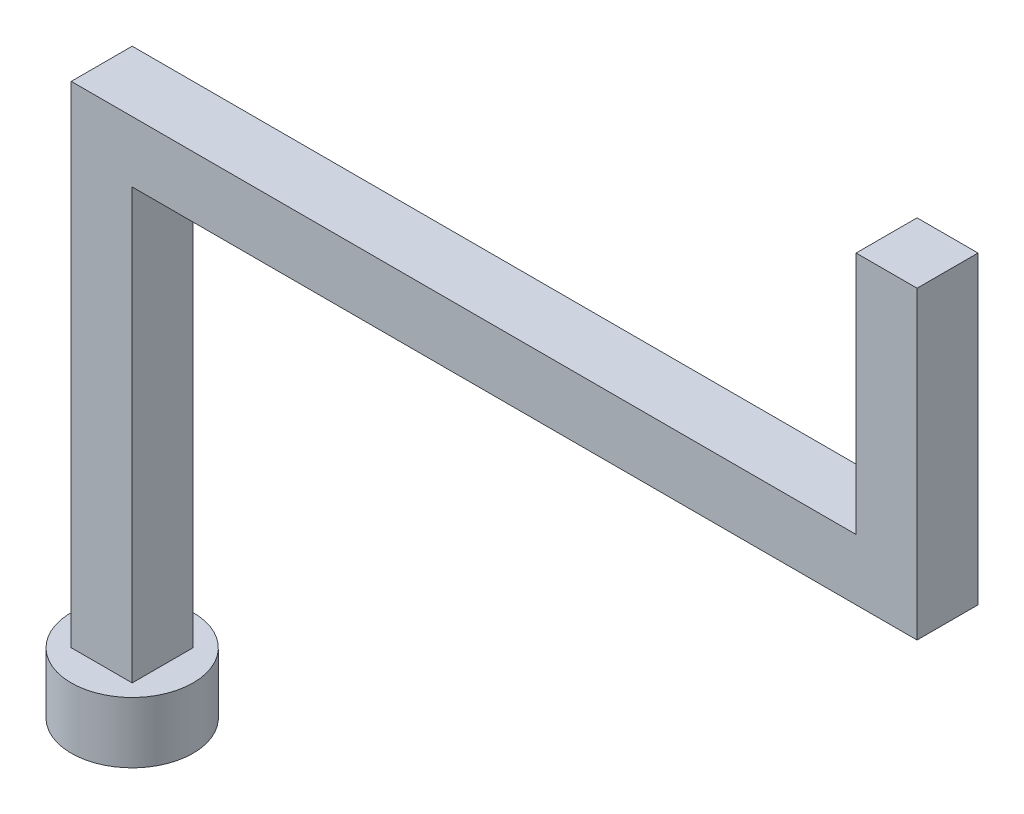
from build123d import *

# Parameters (mm, degrees)
BOSS_EXTRUDE1_DEPTH = 3.175
SKETCH2_R           = 3.175
BOSS_EXTRUDE2_DEPTH = 3.175


with BuildPart() as part:
    # Sketch1 → Boss-Extrude1 (new body)
    with BuildSketch(Plane.XY):
        Polygon((0, 0), (-3.175, 0), (-3.175, 15.875), (-3.175, 25.552862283), (37.713560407, 25.552862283), (37.713560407, 38.252862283), (40.888560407, 38.252862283), (40.888560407, 28.920375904), (40.888560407, 25.552862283), (40.888560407, 22.377862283), (0, 22.377862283), (0, 12.7), align=None)
    extrude(amount=BOSS_EXTRUDE1_DEPTH)

    # Sketch2 → Boss-Extrude2 (add)
    with BuildSketch(Plane.XZ):
        with Locations((-1.5875, 1.5875)):
            Circle(SKETCH2_R)
    extrude(amount=BOSS_EXTRUDE2_DEPTH)


solid = part.part
